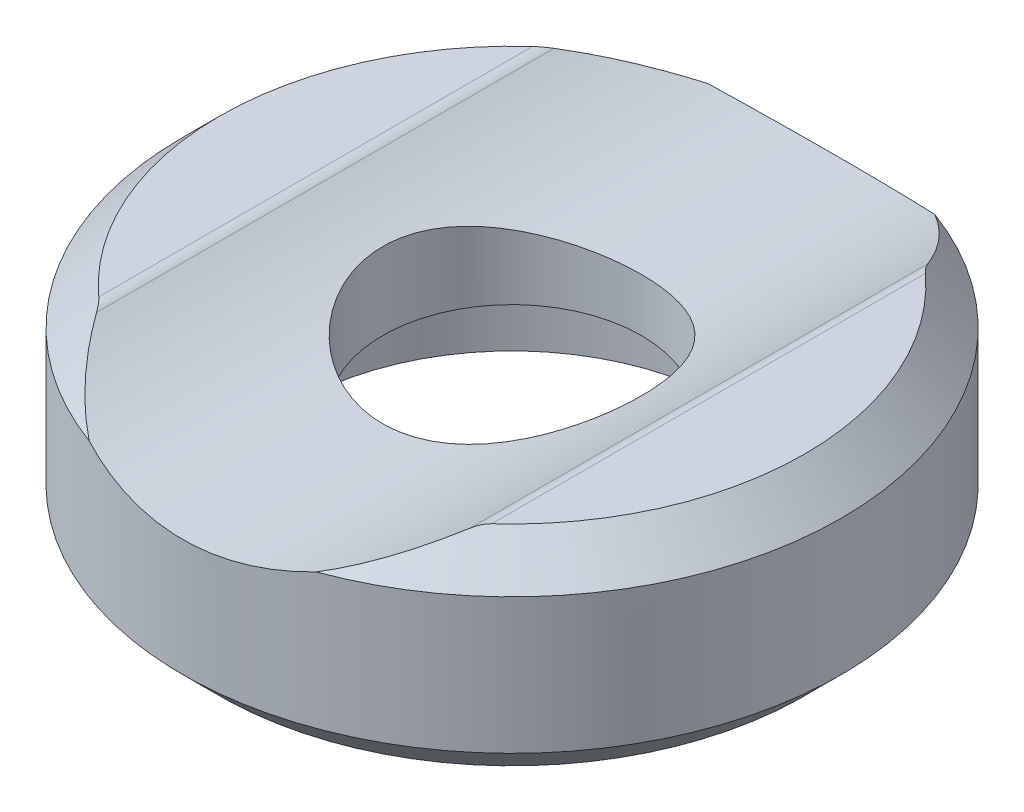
ISO-10303-21;
HEADER;
FILE_DESCRIPTION(('STEP AP214'),'2;1');
FILE_NAME('part.step','',(''),(''),'','','');
FILE_SCHEMA(('AUTOMOTIVE_DESIGN { 1 0 10303 214 1 1 1 1 }'));
ENDSEC;
DATA;
#1=APPLICATION_CONTEXT('core data for automotive mechanical design processes');
#2=APPLICATION_PROTOCOL_DEFINITION('international standard','automotive_design',2000,#1);
#3=PRODUCT_CONTEXT('',#1,'mechanical');
#4=PRODUCT('Part','Part','',(#3));
#5=PRODUCT_RELATED_PRODUCT_CATEGORY('part','',(#4));
#6=PRODUCT_DEFINITION_FORMATION('','',#4);
#7=PRODUCT_DEFINITION_CONTEXT('part definition',#1,'design');
#8=PRODUCT_DEFINITION('design','',#6,#7);
#9=PRODUCT_DEFINITION_SHAPE('','',#8);
#10=(LENGTH_UNIT() NAMED_UNIT(*) SI_UNIT(.MILLI.,.METRE.));
#11=(NAMED_UNIT(*) PLANE_ANGLE_UNIT() SI_UNIT($,.RADIAN.));
#12=(NAMED_UNIT(*) SI_UNIT($,.STERADIAN.) SOLID_ANGLE_UNIT());
#13=UNCERTAINTY_MEASURE_WITH_UNIT(LENGTH_MEASURE(1.E-05),#10,'distance_accuracy_value','');
#14=(GEOMETRIC_REPRESENTATION_CONTEXT(3) GLOBAL_UNCERTAINTY_ASSIGNED_CONTEXT((#13)) GLOBAL_UNIT_ASSIGNED_CONTEXT((#10,
#11,#12)) REPRESENTATION_CONTEXT('',''));
#15=CARTESIAN_POINT('',(0.,0.,0.));
#16=DIRECTION('',(0.,0.,1.));
#17=DIRECTION('',(1.,0.,0.));
#18=AXIS2_PLACEMENT_3D('',#15,#16,#17);
#19=CARTESIAN_POINT('',(0.,0.,0.));
#20=DIRECTION('',(0.,-1.,0.));
#21=DIRECTION('',(0.,0.,-1.));
#22=AXIS2_PLACEMENT_3D('',#19,#20,#21);
#23=CYLINDRICAL_SURFACE('',#22,2.1);
#24=CARTESIAN_POINT('',(0.,1.64120486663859,0.));
#25=DIRECTION('',(0.,-1.,0.));
#26=DIRECTION('',(0.,0.,-1.));
#27=AXIS2_PLACEMENT_3D('',#24,#25,#26);
#28=CIRCLE('',#27,2.1);
#29=CARTESIAN_POINT('',(0.,1.64120486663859,-2.1));
#30=VERTEX_POINT('',#29);
#31=EDGE_CURVE('E85',#30,#30,#28,.T.);
#32=ORIENTED_EDGE('',*,*,#31,.T.);
#33=EDGE_LOOP('',(#32));
#34=FACE_BOUND('',#33,.T.);
#35=CARTESIAN_POINT('',(0.,2.5,-2.1));
#36=CARTESIAN_POINT('',(-0.113834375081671,2.50000489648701,-2.09999346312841));
#37=CARTESIAN_POINT('',(-0.227778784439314,2.50338724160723,-2.09070011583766));
#38=CARTESIAN_POINT('',(-0.452399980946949,2.51657143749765,-2.05385739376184));
#39=CARTESIAN_POINT('',(-0.563071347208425,2.52638337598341,-2.02627933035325));
#40=CARTESIAN_POINT('',(-0.777689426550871,2.55136160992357,-1.9539669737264));
#41=CARTESIAN_POINT('',(-0.881652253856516,2.56651446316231,-1.90927572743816));
#42=CARTESIAN_POINT('',(-1.08056265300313,2.60065068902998,-1.80417450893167));
#43=CARTESIAN_POINT('',(-1.17551089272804,2.61963377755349,-1.74376570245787));
#44=CARTESIAN_POINT('',(-1.35755210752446,2.66031307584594,-1.60639969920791));
#45=CARTESIAN_POINT('',(-1.44423631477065,2.68208262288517,-1.52892262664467));
#46=CARTESIAN_POINT('',(-1.60370788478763,2.72550762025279,-1.36072028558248));
#47=CARTESIAN_POINT('',(-1.67649072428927,2.74716303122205,-1.26999072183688));
#48=CARTESIAN_POINT('',(-1.8085904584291,2.7887411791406,-1.07398564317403));
#49=CARTESIAN_POINT('',(-1.86734722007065,2.80857680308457,-0.968312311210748));
#50=CARTESIAN_POINT('',(-1.96607492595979,2.84314138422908,-0.747751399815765));
#51=CARTESIAN_POINT('',(-2.00605284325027,2.85787223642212,-0.632867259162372));
#52=CARTESIAN_POINT('',(-2.06450573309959,2.87978208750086,-0.401818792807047));
#53=CARTESIAN_POINT('',(-2.0837538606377,2.88723158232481,-0.285876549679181));
#54=CARTESIAN_POINT('',(-2.10261843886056,2.89452979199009,-0.0521870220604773));
#55=CARTESIAN_POINT('',(-2.10224231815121,2.89438138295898,0.0655595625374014));
#56=CARTESIAN_POINT('',(-2.08246322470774,2.88673504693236,0.292602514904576));
#57=CARTESIAN_POINT('',(-2.06411143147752,2.87964316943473,0.402006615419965));
#58=CARTESIAN_POINT('',(-2.01063216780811,2.8595804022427,0.616062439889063));
#59=CARTESIAN_POINT('',(-1.97550227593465,2.84660866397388,0.72071347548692));
#60=CARTESIAN_POINT('',(-1.88885121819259,2.81598888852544,0.924514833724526));
#61=CARTESIAN_POINT('',(-1.83704482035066,2.79826044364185,1.02353127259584));
#62=CARTESIAN_POINT('',(-1.71871230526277,2.76015492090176,1.21177435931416));
#63=CARTESIAN_POINT('',(-1.65218206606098,2.73977710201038,1.30099825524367));
#64=CARTESIAN_POINT('',(-1.50141514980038,2.69712093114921,1.4729649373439));
#65=CARTESIAN_POINT('',(-1.4163348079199,2.67480318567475,1.55495992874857));
#66=CARTESIAN_POINT('',(-1.23333530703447,2.63186921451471,1.70375888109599));
#67=CARTESIAN_POINT('',(-1.13541036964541,2.61125376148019,1.77055596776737));
#68=CARTESIAN_POINT('',(-0.927669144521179,2.57368141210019,1.88781878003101));
#69=CARTESIAN_POINT('',(-0.817703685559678,2.55678065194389,1.93803901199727));
#70=CARTESIAN_POINT('',(-0.590234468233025,2.52897988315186,2.01894346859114));
#71=CARTESIAN_POINT('',(-0.472746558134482,2.51806769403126,2.04966736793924));
#72=CARTESIAN_POINT('',(-0.295116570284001,2.50721584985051,2.08000446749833));
#73=CARTESIAN_POINT('',(-0.236386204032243,2.5045187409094,2.08749239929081));
#74=CARTESIAN_POINT('',(-0.118447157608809,2.50090954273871,2.0974918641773));
#75=CARTESIAN_POINT('',(-0.0592384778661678,2.4999974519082,2.10000340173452));
#76=CARTESIAN_POINT('',(0.113834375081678,2.50000489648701,2.09999346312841));
#77=CARTESIAN_POINT('',(0.227778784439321,2.50338724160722,2.09070011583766));
#78=CARTESIAN_POINT('',(0.452399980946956,2.51657143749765,2.05385739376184));
#79=CARTESIAN_POINT('',(0.563071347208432,2.52638337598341,2.02627933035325));
#80=CARTESIAN_POINT('',(0.777689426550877,2.55136160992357,1.95396697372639));
#81=CARTESIAN_POINT('',(0.881652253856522,2.56651446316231,1.90927572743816));
#82=CARTESIAN_POINT('',(1.08056265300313,2.60065068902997,1.80417450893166));
#83=CARTESIAN_POINT('',(1.17551089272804,2.61963377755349,1.74376570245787));
#84=CARTESIAN_POINT('',(1.35755210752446,2.66031307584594,1.60639969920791));
#85=CARTESIAN_POINT('',(1.44423631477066,2.68208262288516,1.52892262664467));
#86=CARTESIAN_POINT('',(1.60370788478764,2.72550762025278,1.36072028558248));
#87=CARTESIAN_POINT('',(1.67649072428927,2.74716303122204,1.26999072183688));
#88=CARTESIAN_POINT('',(1.8085904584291,2.7887411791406,1.07398564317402));
#89=CARTESIAN_POINT('',(1.86734722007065,2.80857680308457,0.968312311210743));
#90=CARTESIAN_POINT('',(1.96607492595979,2.84314138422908,0.747751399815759));
#91=CARTESIAN_POINT('',(2.00605284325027,2.85787223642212,0.632867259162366));
#92=CARTESIAN_POINT('',(2.06450573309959,2.87978208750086,0.401818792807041));
#93=CARTESIAN_POINT('',(2.0837538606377,2.88723158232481,0.285876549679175));
#94=CARTESIAN_POINT('',(2.10261843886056,2.89452979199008,0.0521870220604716));
#95=CARTESIAN_POINT('',(2.10224231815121,2.89438138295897,-0.0655595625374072));
#96=CARTESIAN_POINT('',(2.08246322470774,2.88673504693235,-0.292602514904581));
#97=CARTESIAN_POINT('',(2.06411143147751,2.87964316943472,-0.40200661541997));
#98=CARTESIAN_POINT('',(2.01063216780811,2.85958040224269,-0.616062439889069));
#99=CARTESIAN_POINT('',(1.97550227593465,2.84660866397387,-0.720713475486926));
#100=CARTESIAN_POINT('',(1.88885121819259,2.81598888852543,-0.924514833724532));
#101=CARTESIAN_POINT('',(1.83704482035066,2.79826044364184,-1.02353127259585));
#102=CARTESIAN_POINT('',(1.71871230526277,2.76015492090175,-1.21177435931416));
#103=CARTESIAN_POINT('',(1.65218206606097,2.73977710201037,-1.30099825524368));
#104=CARTESIAN_POINT('',(1.50141514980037,2.6971209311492,-1.4729649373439));
#105=CARTESIAN_POINT('',(1.4163348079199,2.67480318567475,-1.55495992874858));
#106=CARTESIAN_POINT('',(1.23333530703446,2.6318692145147,-1.703758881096));
#107=CARTESIAN_POINT('',(1.1354103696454,2.61125376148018,-1.77055596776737));
#108=CARTESIAN_POINT('',(0.927669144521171,2.57368141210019,-1.88781878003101));
#109=CARTESIAN_POINT('',(0.81770368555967,2.55678065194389,-1.93803901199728));
#110=CARTESIAN_POINT('',(0.590234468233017,2.52897988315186,-2.01894346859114));
#111=CARTESIAN_POINT('',(0.472746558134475,2.51806769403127,-2.04966736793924));
#112=CARTESIAN_POINT('',(0.295116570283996,2.50721584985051,-2.08000446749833));
#113=CARTESIAN_POINT('',(0.236386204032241,2.5045187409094,-2.08749239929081));
#114=CARTESIAN_POINT('',(0.118447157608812,2.50090954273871,-2.0974918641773));
#115=CARTESIAN_POINT('',(0.0592384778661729,2.4999974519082,-2.10000340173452));
#116=CARTESIAN_POINT('',(0.,2.5,-2.1));
#117=B_SPLINE_CURVE_WITH_KNOTS('',3,(#35,#36,#37,#38,#39,#40,#41,#42,#43,#44,#45,#46,#47,#48,
#49,#50,#51,#52,#53,#54,#55,#56,#57,#58,#59,#60,#61,#62,#63,#64,#65,#66,#67,#68,#69,#70,#71,#72,
#73,#74,#75,#76,#77,#78,#79,#80,#81,#82,#83,#84,#85,#86,#87,#88,#89,#90,#91,#92,#93,#94,#95,#96,
#97,#98,#99,#100,#101,#102,#103,#104,#105,#106,#107,#108,#109,#110,#111,#112,#113,#114,#115,
#116),.UNSPECIFIED.,.T.,.F.,(4,2,2,2,2,2,2,2,2,2,2,2,2,2,2,2,2,2,2,2,2,2,2,2,2,2,2,2,2,2,2,2,2,
2,2,2,2,2,2,2,4),(0.,0.341273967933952,0.683084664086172,1.02404114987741,1.36497235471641,
1.71824488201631,2.07163216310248,2.43738163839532,2.80299519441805,3.15444231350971,
3.50575639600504,3.83768252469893,4.16965657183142,4.50764064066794,4.84571944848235,
5.20481669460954,5.56407604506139,5.92843923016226,6.29205854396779,6.46965488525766,
6.64725106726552,6.98852503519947,7.33033573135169,7.67129221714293,8.01222342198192,
8.36549594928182,8.71888323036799,9.08463270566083,9.45024626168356,9.80169338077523,
10.1530074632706,10.4849335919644,10.8169076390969,11.1548917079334,11.4929705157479,
11.8520677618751,12.2113271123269,12.5756902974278,12.9393096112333,13.1169059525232,
13.294502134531),.UNSPECIFIED.);
#118=CARTESIAN_POINT('',(0.,2.5,-2.1));
#119=VERTEX_POINT('',#118);
#120=EDGE_CURVE('E158',#119,#119,#117,.T.);
#121=ORIENTED_EDGE('',*,*,#120,.T.);
#122=EDGE_LOOP('',(#121));
#123=FACE_BOUND('',#122,.T.);
#124=ADVANCED_FACE('F14',(#34,#123),#23,.F.);
#125=CARTESIAN_POINT('',(0.,0.,0.));
#126=DIRECTION('',(0.,-1.,0.));
#127=DIRECTION('',(0.,0.,-1.));
#128=AXIS2_PLACEMENT_3D('',#125,#126,#127);
#129=CYLINDRICAL_SURFACE('',#128,5.35);
#130=CARTESIAN_POINT('',(-1.84119526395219,2.8,-5.02319619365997));
#131=CARTESIAN_POINT('',(-1.73657275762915,2.76495994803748,-5.06156008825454));
#132=CARTESIAN_POINT('',(-1.62991848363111,2.73259209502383,-5.09692951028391));
#133=CARTESIAN_POINT('',(-1.41300381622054,2.67363178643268,-5.16126837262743));
#134=CARTESIAN_POINT('',(-1.30273945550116,2.64704594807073,-5.19023048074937));
#135=CARTESIAN_POINT('',(-1.0799133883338,2.60029067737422,-5.24111486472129));
#136=CARTESIAN_POINT('',(-0.967367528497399,2.5800869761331,-5.26307474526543));
#137=CARTESIAN_POINT('',(-0.740207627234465,2.54628294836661,-5.29979357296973));
#138=CARTESIAN_POINT('',(-0.625595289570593,2.53267741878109,-5.31455819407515));
#139=CARTESIAN_POINT('',(-0.425779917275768,2.51502604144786,-5.33370725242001));
#140=CARTESIAN_POINT('',(-0.340874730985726,2.50939916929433,-5.33980902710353));
#141=CARTESIAN_POINT('',(-0.170649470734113,2.50188463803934,-5.34795701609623));
#142=CARTESIAN_POINT('',(-0.085329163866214,2.49999940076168,-5.35000060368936));
#143=CARTESIAN_POINT('',(0.116454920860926,2.50000081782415,-5.3499991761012));
#144=CARTESIAN_POINT('',(0.232926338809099,2.50351420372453,-5.34619083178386));
#145=CARTESIAN_POINT('',(0.465012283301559,2.51750131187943,-5.33102236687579));
#146=CARTESIAN_POINT('',(0.580626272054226,2.52797908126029,-5.3196578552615));
#147=CARTESIAN_POINT('',(0.810197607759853,2.55570167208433,-5.28956497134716));
#148=CARTESIAN_POINT('',(0.924152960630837,2.57295403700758,-5.27082839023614));
#149=CARTESIAN_POINT('',(1.14950261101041,2.61389773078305,-5.22631181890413));
#150=CARTESIAN_POINT('',(1.26089685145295,2.63758920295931,-5.20053167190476));
#151=CARTESIAN_POINT('',(1.45109980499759,2.68384781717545,-5.15012011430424));
#152=CARTESIAN_POINT('',(1.53066265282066,2.70502406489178,-5.12702218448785));
#153=CARTESIAN_POINT('',(1.68756388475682,2.75033516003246,-5.07753650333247));
#154=CARTESIAN_POINT('',(1.76490923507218,2.77445910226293,-5.0511608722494));
#155=CARTESIAN_POINT('',(1.8411952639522,2.8,-5.02319619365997));
#156=B_SPLINE_CURVE_WITH_KNOTS('',3,(#130,#131,#132,#133,#134,#135,#136,#137,#138,#139,#140,
#141,#142,#143,#144,#145,#146,#147,#148,#149,#150,#151,#152,#153,#154,#155),.UNSPECIFIED.,.F.,
.F.,(4,2,2,2,2,2,2,2,2,2,2,2,4),(0.,0.350408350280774,0.701215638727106,1.0501059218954,
1.3987206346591,1.6544801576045,1.91040517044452,2.2596846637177,2.60916730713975,
2.95904020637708,3.30892089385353,3.56531823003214,3.82079420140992),.UNSPECIFIED.);
#157=CARTESIAN_POINT('',(-1.84119526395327,2.80000000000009,-5.02319619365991));
#158=VERTEX_POINT('',#157);
#159=CARTESIAN_POINT('',(1.84119526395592,2.80000000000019,-5.02319619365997));
#160=VERTEX_POINT('',#159);
#161=EDGE_CURVE('E43',#158,#160,#156,.T.);
#162=ORIENTED_EDGE('',*,*,#161,.T.);
#163=CARTESIAN_POINT('',(0.,2.8,0.));
#164=DIRECTION('',(0.,-1.,0.));
#165=DIRECTION('',(0.,0.,-1.));
#166=AXIS2_PLACEMENT_3D('',#163,#164,#165);
#167=CIRCLE('',#166,5.35);
#168=CARTESIAN_POINT('',(1.84119526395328,2.80000000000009,5.0231961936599));
#169=VERTEX_POINT('',#168);
#170=EDGE_CURVE('E155',#160,#169,#167,.T.);
#171=ORIENTED_EDGE('',*,*,#170,.T.);
#172=CARTESIAN_POINT('',(1.8411952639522,2.8,5.02319619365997));
#173=CARTESIAN_POINT('',(1.73657275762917,2.76495994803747,5.06156008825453));
#174=CARTESIAN_POINT('',(1.62991848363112,2.73259209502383,5.09692951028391));
#175=CARTESIAN_POINT('',(1.41300381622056,2.67363178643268,5.16126837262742));
#176=CARTESIAN_POINT('',(1.30273945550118,2.64704594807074,5.19023048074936));
#177=CARTESIAN_POINT('',(1.07991338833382,2.60029067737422,5.24111486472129));
#178=CARTESIAN_POINT('',(0.967367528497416,2.5800869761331,5.26307474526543));
#179=CARTESIAN_POINT('',(0.74020762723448,2.54628294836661,5.29979357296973));
#180=CARTESIAN_POINT('',(0.625595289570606,2.53267741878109,5.31455819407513));
#181=CARTESIAN_POINT('',(0.425779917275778,2.51502604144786,5.33370725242));
#182=CARTESIAN_POINT('',(0.340874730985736,2.50939916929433,5.33980902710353));
#183=CARTESIAN_POINT('',(0.170649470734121,2.50188463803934,5.34795701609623));
#184=CARTESIAN_POINT('',(0.0853291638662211,2.49999940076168,5.35000060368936));
#185=CARTESIAN_POINT('',(-0.11645492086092,2.50000081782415,5.34999917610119));
#186=CARTESIAN_POINT('',(-0.232926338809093,2.50351420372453,5.34619083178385));
#187=CARTESIAN_POINT('',(-0.465012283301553,2.51750131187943,5.33102236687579));
#188=CARTESIAN_POINT('',(-0.58062627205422,2.52797908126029,5.3196578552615));
#189=CARTESIAN_POINT('',(-0.810197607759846,2.55570167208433,5.28956497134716));
#190=CARTESIAN_POINT('',(-0.924152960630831,2.57295403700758,5.27082839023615));
#191=CARTESIAN_POINT('',(-1.14950261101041,2.61389773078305,5.22631181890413));
#192=CARTESIAN_POINT('',(-1.26089685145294,2.63758920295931,5.20053167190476));
#193=CARTESIAN_POINT('',(-1.45109980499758,2.68384781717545,5.15012011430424));
#194=CARTESIAN_POINT('',(-1.53066265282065,2.70502406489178,5.12702218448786));
#195=CARTESIAN_POINT('',(-1.6875638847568,2.75033516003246,5.07753650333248));
#196=CARTESIAN_POINT('',(-1.76490923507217,2.77445910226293,5.0511608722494));
#197=CARTESIAN_POINT('',(-1.84119526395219,2.8,5.02319619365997));
#198=B_SPLINE_CURVE_WITH_KNOTS('',3,(#172,#173,#174,#175,#176,#177,#178,#179,#180,#181,#182,
#183,#184,#185,#186,#187,#188,#189,#190,#191,#192,#193,#194,#195,#196,#197),.UNSPECIFIED.,.F.,
.F.,(4,2,2,2,2,2,2,2,2,2,2,2,4),(0.,0.350408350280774,0.701215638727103,1.0501059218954,
1.3987206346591,1.6544801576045,1.91040517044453,2.2596846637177,2.60916730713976,
2.95904020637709,3.30892089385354,3.56531823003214,3.82079420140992),.UNSPECIFIED.);
#199=CARTESIAN_POINT('',(-1.84119526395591,2.80000000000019,5.02319619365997));
#200=VERTEX_POINT('',#199);
#201=EDGE_CURVE('E150',#169,#200,#198,.T.);
#202=ORIENTED_EDGE('',*,*,#201,.T.);
#203=EDGE_CURVE('E78',#200,#158,#167,.T.);
#204=ORIENTED_EDGE('',*,*,#203,.T.);
#205=EDGE_LOOP('',(#162,#171,#202,#204));
#206=FACE_BOUND('',#205,.T.);
#207=CARTESIAN_POINT('',(0.,0.6,0.));
#208=DIRECTION('',(0.,-1.,0.));
#209=DIRECTION('',(0.,0.,-1.));
#210=AXIS2_PLACEMENT_3D('',#207,#208,#209);
#211=CIRCLE('',#210,5.35);
#212=CARTESIAN_POINT('',(0.,0.6,-5.35));
#213=VERTEX_POINT('',#212);
#214=EDGE_CURVE('E215',#213,#213,#211,.T.);
#215=ORIENTED_EDGE('',*,*,#214,.F.);
#216=EDGE_LOOP('',(#215));
#217=FACE_BOUND('',#216,.T.);
#218=ADVANCED_FACE('F153',(#206,#217),#129,.T.);
#219=CARTESIAN_POINT('',(0.,2.8,0.));
#220=DIRECTION('',(0.,-1.,0.));
#221=DIRECTION('',(0.,0.,-1.));
#222=AXIS2_PLACEMENT_3D('',#219,#220,#221);
#223=CONICAL_SURFACE('',#222,5.35,0.785398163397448);
#224=ORIENTED_EDGE('',*,*,#170,.F.);
#225=CARTESIAN_POINT('',(1.66534615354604,2.74422622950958,-5.142860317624));
#226=CARTESIAN_POINT('',(1.77685973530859,2.77766710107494,-5.07158142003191));
#227=CARTESIAN_POINT('',(1.88384919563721,2.81338115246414,-4.99463492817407));
#228=CARTESIAN_POINT('',(2.08875634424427,2.88806825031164,-4.83123296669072));
#229=CARTESIAN_POINT('',(2.18669047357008,2.92703513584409,-4.74479537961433));
#230=CARTESIAN_POINT('',(2.37231759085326,3.00640738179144,-4.56546583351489));
#231=CARTESIAN_POINT('',(2.46015390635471,3.0467780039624,-4.47270525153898));
#232=CARTESIAN_POINT('',(2.62779720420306,3.12859953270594,-4.28062174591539));
#233=CARTESIAN_POINT('',(2.70760265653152,3.17005064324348,-4.1812975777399));
#234=CARTESIAN_POINT('',(2.84452268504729,3.24495083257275,-3.9971901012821));
#235=CARTESIAN_POINT('',(2.9030079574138,3.27836550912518,-3.91340319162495));
#236=CARTESIAN_POINT('',(3.0155728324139,3.34514204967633,-3.74198102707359));
#237=CARTESIAN_POINT('',(3.06961933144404,3.37850196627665,-3.65432324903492));
#238=CARTESIAN_POINT('',(3.12132663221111,3.41151147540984,-3.56519193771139));
#239=B_SPLINE_CURVE_WITH_KNOTS('',3,(#225,#226,#227,#228,#229,#230,#231,#232,#233,#234,#235,
#236,#237,#238),.UNSPECIFIED.,.F.,.F.,(4,2,2,2,2,2,4),(0.,0.409053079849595,0.81734825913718,
1.2188475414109,1.62042317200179,1.94278602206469,2.26736822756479),.UNSPECIFIED.);
#240=CARTESIAN_POINT('',(3.0322055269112,3.35573770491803,-3.713580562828));
#241=VERTEX_POINT('',#240);
#242=EDGE_CURVE('E90',#160,#241,#239,.T.);
#243=ORIENTED_EDGE('',*,*,#242,.T.);
#244=CARTESIAN_POINT('',(3.20492756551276,3.39957921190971,-3.50641368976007));
#245=CARTESIAN_POINT('',(3.19511545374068,3.40009307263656,-3.51468653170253));
#246=CARTESIAN_POINT('',(3.18558303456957,3.4001220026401,-3.52328921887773));
#247=CARTESIAN_POINT('',(3.16706413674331,3.39933841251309,-3.54099604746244));
#248=CARTESIAN_POINT('',(3.15807663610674,3.39852752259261,-3.55009918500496));
#249=CARTESIAN_POINT('',(3.13210470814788,3.39505997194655,-3.57770898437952));
#250=CARTESIAN_POINT('',(3.11583442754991,3.39137545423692,-3.59675895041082));
#251=CARTESIAN_POINT('',(3.08655030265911,3.38232390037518,-3.63378964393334));
#252=CARTESIAN_POINT('',(3.07337367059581,3.3771547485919,-3.65169483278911));
#253=CARTESIAN_POINT('',(3.04820533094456,3.36525040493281,-3.68818867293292));
#254=CARTESIAN_POINT('',(3.03623116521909,3.35849581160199,-3.70678317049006));
#255=CARTESIAN_POINT('',(3.02490043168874,3.35111147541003,-3.72549438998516));
#256=B_SPLINE_CURVE_WITH_KNOTS('',3,(#244,#245,#246,#247,#248,#249,#250,#251,#252,#253,#254,
#255),.UNSPECIFIED.,.F.,.F.,(4,2,2,2,2,4),(0.,0.0384856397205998,0.0768967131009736,
0.152626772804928,0.221010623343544,0.290279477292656),.UNSPECIFIED.);
#257=CARTESIAN_POINT('',(3.18904374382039,3.4,-3.52029828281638));
#258=VERTEX_POINT('',#257);
#259=EDGE_CURVE('E82',#258,#241,#256,.T.);
#260=ORIENTED_EDGE('',*,*,#259,.F.);
#261=CARTESIAN_POINT('',(0.,3.4,0.));
#262=DIRECTION('',(0.,-1.,0.));
#263=DIRECTION('',(0.,0.,-1.));
#264=AXIS2_PLACEMENT_3D('',#261,#262,#263);
#265=CIRCLE('',#264,4.75);
#266=CARTESIAN_POINT('',(3.18904374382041,3.4,3.52029828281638));
#267=VERTEX_POINT('',#266);
#268=EDGE_CURVE('E73',#258,#267,#265,.T.);
#269=ORIENTED_EDGE('',*,*,#268,.T.);
#270=CARTESIAN_POINT('',(3.02490043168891,3.35111147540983,3.72549438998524));
#271=CARTESIAN_POINT('',(3.03528530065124,3.35788476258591,3.70833841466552));
#272=CARTESIAN_POINT('',(3.04621812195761,3.36412618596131,3.69127766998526));
#273=CARTESIAN_POINT('',(3.0693193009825,3.375380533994,3.65741158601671));
#274=CARTESIAN_POINT('',(3.08149564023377,3.3803847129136,3.64060881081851));
#275=CARTESIAN_POINT('',(3.1066911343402,3.38877072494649,3.60806988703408));
#276=CARTESIAN_POINT('',(3.119673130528,3.39219748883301,3.59231683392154));
#277=CARTESIAN_POINT('',(3.14686265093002,3.39734149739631,3.56166094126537));
#278=CARTESIAN_POINT('',(3.16106608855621,3.39906421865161,3.54675552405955));
#279=CARTESIAN_POINT('',(3.18062296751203,3.39991816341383,3.52802456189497));
#280=CARTESIAN_POINT('',(3.18537318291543,3.40001623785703,3.52360406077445));
#281=CARTESIAN_POINT('',(3.19503374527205,3.39997927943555,3.51489667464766));
#282=CARTESIAN_POINT('',(3.19994473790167,3.39984315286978,3.51061051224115));
#283=CARTESIAN_POINT('',(3.20492756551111,3.39957921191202,3.50641368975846));
#284=B_SPLINE_CURVE_WITH_KNOTS('',3,(#270,#271,#272,#273,#274,#275,#276,#277,#278,#279,#280,
#281,#282,#283),.UNSPECIFIED.,.F.,.F.,(4,2,2,2,2,2,4),(0.,0.0635207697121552,0.127478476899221,
0.189480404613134,0.25128241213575,0.270745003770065,0.290298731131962),.UNSPECIFIED.);
#285=CARTESIAN_POINT('',(3.0322055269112,3.35573770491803,3.713580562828));
#286=VERTEX_POINT('',#285);
#287=EDGE_CURVE('E35',#286,#267,#284,.T.);
#288=ORIENTED_EDGE('',*,*,#287,.F.);
#289=CARTESIAN_POINT('',(3.12132663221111,3.41151147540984,3.56519193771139));
#290=CARTESIAN_POINT('',(3.04649551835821,3.36375814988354,3.69413057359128));
#291=CARTESIAN_POINT('',(2.96676223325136,3.31524099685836,3.82006864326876));
#292=CARTESIAN_POINT('',(2.79664010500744,3.21782331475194,4.0651217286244));
#293=CARTESIAN_POINT('',(2.70621272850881,3.16892203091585,4.18420962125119));
#294=CARTESIAN_POINT('',(2.51673118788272,3.07343034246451,4.41097191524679));
#295=CARTESIAN_POINT('',(2.41794017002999,3.0268126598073,4.51885339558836));
#296=CARTESIAN_POINT('',(2.20956112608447,2.93616558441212,4.72453616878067));
#297=CARTESIAN_POINT('',(2.09999407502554,2.89213141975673,4.822356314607));
#298=CARTESIAN_POINT('',(1.93394201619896,2.83165443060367,4.95465047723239));
#299=CARTESIAN_POINT('',(1.88193459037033,2.81352072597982,4.99402579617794));
#300=CARTESIAN_POINT('',(1.77544601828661,2.77813847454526,5.07037333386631));
#301=CARTESIAN_POINT('',(1.72095318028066,2.76089515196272,5.1073316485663));
#302=CARTESIAN_POINT('',(1.66534615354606,2.74422622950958,5.14286031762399));
#303=B_SPLINE_CURVE_WITH_KNOTS('',3,(#289,#290,#291,#292,#293,#294,#295,#296,#297,#298,#299,
#300,#301,#302),.UNSPECIFIED.,.F.,.F.,(4,2,2,2,2,2,4),(0.,0.469679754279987,0.941106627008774,
1.40107352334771,1.86016219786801,2.06319802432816,2.26731437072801),.UNSPECIFIED.);
#304=EDGE_CURVE('E129',#286,#169,#303,.T.);
#305=ORIENTED_EDGE('',*,*,#304,.T.);
#306=EDGE_LOOP('',(#224,#243,#260,#269,#288,#305));
#307=FACE_BOUND('',#306,.T.);
#308=ADVANCED_FACE('F89',(#307),#223,.T.);
#309=CARTESIAN_POINT('',(4.75,3.4,0.));
#310=DIRECTION('',(0.,1.,0.));
#311=DIRECTION('',(0.,0.,1.));
#312=AXIS2_PLACEMENT_3D('',#309,#310,#311);
#313=PLANE('',#312);
#314=ORIENTED_EDGE('',*,*,#268,.F.);
#315=DIRECTION('',(0.,0.,-1.));
#316=VECTOR('',#315,1.);
#317=CARTESIAN_POINT('',(3.18904374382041,3.4,6.35));
#318=LINE('',#317,#316);
#319=EDGE_CURVE('E75',#258,#267,#318,.F.);
#320=ORIENTED_EDGE('',*,*,#319,.T.);
#321=EDGE_LOOP('',(#314,#320));
#322=FACE_BOUND('',#321,.T.);
#323=ADVANCED_FACE('F74',(#322),#313,.T.);
#324=CARTESIAN_POINT('',(0.,1.64120486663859,0.));
#325=DIRECTION('',(0.,-1.,0.));
#326=DIRECTION('',(0.,0.,-1.));
#327=AXIS2_PLACEMENT_3D('',#324,#325,#326);
#328=CONICAL_SURFACE('',#327,2.1,1.02974425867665);
#329=CARTESIAN_POINT('',(0.,0.8,0.));
#330=DIRECTION('',(0.,-1.,0.));
#331=DIRECTION('',(0.,0.,-1.));
#332=AXIS2_PLACEMENT_3D('',#329,#330,#331);
#333=CIRCLE('',#332,3.5);
#334=CARTESIAN_POINT('',(0.,0.8,-3.5));
#335=VERTEX_POINT('',#334);
#336=EDGE_CURVE('E224',#335,#335,#333,.T.);
#337=ORIENTED_EDGE('',*,*,#336,.T.);
#338=EDGE_LOOP('',(#337));
#339=FACE_BOUND('',#338,.T.);
#340=ORIENTED_EDGE('',*,*,#31,.F.);
#341=EDGE_LOOP('',(#340));
#342=FACE_BOUND('',#341,.T.);
#343=ADVANCED_FACE('F188',(#339,#342),#328,.F.);
#344=CARTESIAN_POINT('',(0.,0.,0.));
#345=DIRECTION('',(0.,-1.,0.));
#346=DIRECTION('',(0.,0.,-1.));
#347=AXIS2_PLACEMENT_3D('',#344,#345,#346);
#348=CYLINDRICAL_SURFACE('',#347,3.5);
#349=CARTESIAN_POINT('',(0.,0.,0.));
#350=DIRECTION('',(0.,-1.,0.));
#351=DIRECTION('',(0.,0.,-1.));
#352=AXIS2_PLACEMENT_3D('',#349,#350,#351);
#353=CIRCLE('',#352,3.5);
#354=CARTESIAN_POINT('',(0.,0.,-3.5));
#355=VERTEX_POINT('',#354);
#356=EDGE_CURVE('E221',#355,#355,#353,.T.);
#357=ORIENTED_EDGE('',*,*,#356,.T.);
#358=EDGE_LOOP('',(#357));
#359=FACE_BOUND('',#358,.T.);
#360=ORIENTED_EDGE('',*,*,#336,.F.);
#361=EDGE_LOOP('',(#360));
#362=FACE_BOUND('',#361,.T.);
#363=ADVANCED_FACE('F185',(#359,#362),#348,.F.);
#364=CARTESIAN_POINT('',(3.5,0.,0.));
#365=DIRECTION('',(0.,-1.,0.));
#366=DIRECTION('',(0.,0.,-1.));
#367=AXIS2_PLACEMENT_3D('',#364,#365,#366);
#368=PLANE('',#367);
#369=CARTESIAN_POINT('',(0.,0.,0.));
#370=DIRECTION('',(0.,-1.,0.));
#371=DIRECTION('',(0.,0.,-1.));
#372=AXIS2_PLACEMENT_3D('',#369,#370,#371);
#373=CIRCLE('',#372,4.75);
#374=CARTESIAN_POINT('',(0.,0.,-4.75));
#375=VERTEX_POINT('',#374);
#376=EDGE_CURVE('E218',#375,#375,#373,.T.);
#377=ORIENTED_EDGE('',*,*,#376,.T.);
#378=EDGE_LOOP('',(#377));
#379=FACE_BOUND('',#378,.T.);
#380=ORIENTED_EDGE('',*,*,#356,.F.);
#381=EDGE_LOOP('',(#380));
#382=FACE_BOUND('',#381,.T.);
#383=ADVANCED_FACE('F181',(#379,#382),#368,.T.);
#384=CARTESIAN_POINT('',(0.,0.,0.));
#385=DIRECTION('',(0.,1.,0.));
#386=DIRECTION('',(0.,0.,1.));
#387=AXIS2_PLACEMENT_3D('',#384,#385,#386);
#388=CONICAL_SURFACE('',#387,4.75,0.785398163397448);
#389=ORIENTED_EDGE('',*,*,#214,.T.);
#390=EDGE_LOOP('',(#389));
#391=FACE_BOUND('',#390,.T.);
#392=ORIENTED_EDGE('',*,*,#376,.F.);
#393=EDGE_LOOP('',(#392));
#394=FACE_BOUND('',#393,.T.);
#395=ADVANCED_FACE('F177',(#391,#394),#388,.T.);
#396=CARTESIAN_POINT('',(-3.02490042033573,3.35111146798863,-3.72549440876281));
#397=CARTESIAN_POINT('',(-3.03528528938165,3.35788475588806,-3.70833843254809));
#398=CARTESIAN_POINT('',(-3.04621811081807,3.36412617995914,-3.69127768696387));
#399=CARTESIAN_POINT('',(-3.06931929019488,3.37538052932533,-3.65741160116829));
#400=CARTESIAN_POINT('',(-3.08149562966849,3.38038470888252,-3.64060882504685));
#401=CARTESIAN_POINT('',(-3.1066911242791,3.3887707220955,-3.60806989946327));
#402=CARTESIAN_POINT('',(-3.11967312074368,3.39219748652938,-3.59231684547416));
#403=CARTESIAN_POINT('',(-3.14686264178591,3.39734149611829,-3.56166095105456));
#404=CARTESIAN_POINT('',(-3.16106607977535,3.39906421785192,-3.54675553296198));
#405=CARTESIAN_POINT('',(-3.18062296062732,3.39991816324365,-3.52802456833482));
#406=CARTESIAN_POINT('',(-3.18537317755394,3.40001623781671,-3.52360406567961));
#407=CARTESIAN_POINT('',(-3.19503374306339,3.39997927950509,-3.51489667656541));
#408=CARTESIAN_POINT('',(-3.19994473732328,3.39984315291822,-3.5106105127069));
#409=CARTESIAN_POINT('',(-3.20492756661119,3.3995792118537,-3.50641368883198));
#410=B_SPLINE_CURVE_WITH_KNOTS('',3,(#396,#397,#398,#399,#400,#401,#402,#403,#404,#405,#406,
#407,#408,#409),.UNSPECIFIED.,.F.,.F.,(4,2,2,2,2,2,4),(0.,0.0635207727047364,0.127478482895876,
0.189480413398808,0.25128242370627,0.270745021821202,0.290298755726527),.UNSPECIFIED.);
#411=CARTESIAN_POINT('',(-3.0322055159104,3.35573769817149,-3.71358058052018));
#412=VERTEX_POINT('',#411);
#413=CARTESIAN_POINT('',(-3.18904374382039,3.4,-3.52029828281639));
#414=VERTEX_POINT('',#413);
#415=EDGE_CURVE('E156',#412,#414,#410,.T.);
#416=ORIENTED_EDGE('',*,*,#415,.F.);
#417=CARTESIAN_POINT('',(-3.12132662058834,3.41151146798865,-3.56519195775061));
#418=CARTESIAN_POINT('',(-3.04649550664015,3.36375814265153,-3.69413059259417));
#419=CARTESIAN_POINT('',(-2.96676222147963,3.3152409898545,-3.82006866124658));
#420=CARTESIAN_POINT('',(-2.79664009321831,3.21782330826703,-4.06512174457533));
#421=CARTESIAN_POINT('',(-2.70621271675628,3.16892202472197,-4.18420963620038));
#422=CARTESIAN_POINT('',(-2.51673117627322,3.07343033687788,-4.41097192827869));
#423=CARTESIAN_POINT('',(-2.41794015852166,3.02681265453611,-4.51885340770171));
#424=CARTESIAN_POINT('',(-2.20956111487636,2.93616557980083,-4.72453617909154));
#425=CARTESIAN_POINT('',(-2.09999406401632,2.89213141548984,-4.82235632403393));
#426=CARTESIAN_POINT('',(-1.93394200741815,2.8316544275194,-4.9546504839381));
#427=CARTESIAN_POINT('',(-1.88193458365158,2.81352072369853,-4.99402580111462));
#428=CARTESIAN_POINT('',(-1.77544601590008,2.77813847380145,-5.07037333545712));
#429=CARTESIAN_POINT('',(-1.72095318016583,2.76089515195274,-5.10733164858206));
#430=CARTESIAN_POINT('',(-1.66534615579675,2.74422623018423,-5.14286031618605));
#431=B_SPLINE_CURVE_WITH_KNOTS('',3,(#417,#418,#419,#420,#421,#422,#423,#424,#425,#426,#427,
#428,#429,#430),.UNSPECIFIED.,.F.,.F.,(4,2,2,2,2,2,4),(0.,0.469679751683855,0.941106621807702,
1.40107351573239,1.86016218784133,2.06319800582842,2.26731434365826),.UNSPECIFIED.);
#432=EDGE_CURVE('E9',#412,#158,#431,.T.);
#433=ORIENTED_EDGE('',*,*,#432,.T.);
#434=ORIENTED_EDGE('',*,*,#203,.F.);
#435=CARTESIAN_POINT('',(-1.66534615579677,2.74422623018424,5.14286031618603));
#436=CARTESIAN_POINT('',(-1.77685973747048,2.77766710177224,5.07158141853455));
#437=CARTESIAN_POINT('',(-1.88384919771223,2.81338115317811,4.99463492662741));
#438=CARTESIAN_POINT('',(-2.08875634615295,2.88806825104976,4.83123296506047));
#439=CARTESIAN_POINT('',(-2.18669047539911,2.92703513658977,4.74479537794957));
#440=CARTESIAN_POINT('',(-2.37231759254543,3.00640738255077,4.56546583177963));
#441=CARTESIAN_POINT('',(-2.46015390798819,3.04677800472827,4.47270524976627));
#442=CARTESIAN_POINT('',(-2.62779720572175,3.12859953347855,4.28062174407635));
#443=CARTESIAN_POINT('',(-2.70760265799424,3.17005064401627,4.1812975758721));
#444=CARTESIAN_POINT('',(-2.84452268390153,3.24495083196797,3.99719010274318));
#445=CARTESIAN_POINT('',(-2.90300795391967,3.27836550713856,3.91340319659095));
#446=CARTESIAN_POINT('',(-3.01557282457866,3.34514204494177,3.74198103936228));
#447=CARTESIAN_POINT('',(-3.06961932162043,3.37850196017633,3.65432326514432));
#448=CARTESIAN_POINT('',(-3.12132662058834,3.41151146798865,3.56519195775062));
#449=B_SPLINE_CURVE_WITH_KNOTS('',3,(#435,#436,#437,#438,#439,#440,#441,#442,#443,#444,#445,
#446,#447,#448),.UNSPECIFIED.,.F.,.F.,(4,2,2,2,2,2,4),(0.,0.409053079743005,0.817348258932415,
1.21884754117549,1.62042317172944,1.94278600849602,2.26736820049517),.UNSPECIFIED.);
#450=CARTESIAN_POINT('',(-3.0322055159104,3.35573769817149,3.71358058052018));
#451=VERTEX_POINT('',#450);
#452=EDGE_CURVE('E28',#200,#451,#449,.T.);
#453=ORIENTED_EDGE('',*,*,#452,.T.);
#454=CARTESIAN_POINT('',(-3.20492756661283,3.39957921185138,3.5064136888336));
#455=CARTESIAN_POINT('',(-3.19511545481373,3.40009307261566,3.51468653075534));
#456=CARTESIAN_POINT('',(-3.18558303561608,3.40012200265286,3.52328921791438));
#457=CARTESIAN_POINT('',(-3.16706413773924,3.39933841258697,3.54099604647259));
#458=CARTESIAN_POINT('',(-3.15807663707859,3.39852752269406,3.55009918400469));
#459=CARTESIAN_POINT('',(-3.13210470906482,3.39505997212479,3.57770898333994));
#460=CARTESIAN_POINT('',(-3.11583442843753,3.39137545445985,3.5967589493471));
#461=CARTESIAN_POINT('',(-3.08655030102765,3.38232389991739,3.63378964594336));
#462=CARTESIAN_POINT('',(-3.0733736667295,3.37715474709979,3.65169483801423));
#463=CARTESIAN_POINT('',(-3.0482053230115,3.36525040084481,3.68818868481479));
#464=CARTESIAN_POINT('',(-3.03623115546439,3.3584958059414,3.70678318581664));
#465=CARTESIAN_POINT('',(-3.02490042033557,3.35111146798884,3.72549440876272));
#466=B_SPLINE_CURVE_WITH_KNOTS('',3,(#454,#455,#456,#457,#458,#459,#460,#461,#462,#463,#464,
#465),.UNSPECIFIED.,.F.,.F.,(4,2,2,2,2,4),(0.,0.0384856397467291,0.076896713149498,
0.152626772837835,0.221010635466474,0.290279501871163),.UNSPECIFIED.);
#467=CARTESIAN_POINT('',(-3.18904374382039,3.4,3.5202982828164));
#468=VERTEX_POINT('',#467);
#469=EDGE_CURVE('E93',#468,#451,#466,.T.);
#470=ORIENTED_EDGE('',*,*,#469,.F.);
#471=EDGE_CURVE('E79',#468,#414,#265,.T.);
#472=ORIENTED_EDGE('',*,*,#471,.T.);
#473=EDGE_LOOP('',(#416,#433,#434,#453,#470,#472));
#474=FACE_BOUND('',#473,.T.);
#475=ADVANCED_FACE('F109',(#474),#223,.T.);
#476=DIRECTION('',(0.,0.,-1.));
#477=VECTOR('',#476,1.);
#478=CARTESIAN_POINT('',(-3.18904374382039,3.4,6.35));
#479=LINE('',#478,#477);
#480=EDGE_CURVE('E84',#414,#468,#479,.F.);
#481=ORIENTED_EDGE('',*,*,#480,.F.);
#482=ORIENTED_EDGE('',*,*,#471,.F.);
#483=EDGE_LOOP('',(#481,#482));
#484=FACE_BOUND('',#483,.T.);
#485=ADVANCED_FACE('F197',(#484),#313,.T.);
#486=CARTESIAN_POINT('',(-3.18904374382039,3.1,6.35));
#487=DIRECTION('',(0.,0.,-1.));
#488=DIRECTION('',(-1.,0.,0.));
#489=AXIS2_PLACEMENT_3D('',#486,#487,#488);
#490=CYLINDRICAL_SURFACE('',#489,0.299999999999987);
#491=ORIENTED_EDGE('',*,*,#415,.T.);
#492=ORIENTED_EDGE('',*,*,#480,.T.);
#493=ORIENTED_EDGE('',*,*,#469,.T.);
#494=DIRECTION('',(0.,0.,-1.));
#495=VECTOR('',#494,1.);
#496=CARTESIAN_POINT('',(-3.0322055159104,3.35573769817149,6.35));
#497=LINE('',#496,#495);
#498=EDGE_CURVE('E91',#451,#412,#497,.T.);
#499=ORIENTED_EDGE('',*,*,#498,.T.);
#500=EDGE_LOOP('',(#491,#492,#493,#499));
#501=FACE_BOUND('',#500,.T.);
#502=ADVANCED_FACE('F228',(#501),#490,.T.);
#503=CARTESIAN_POINT('',(0.,8.3,6.35));
#504=DIRECTION('',(0.,0.,-1.));
#505=DIRECTION('',(-1.,0.,0.));
#506=AXIS2_PLACEMENT_3D('',#503,#504,#505);
#507=CYLINDRICAL_SURFACE('',#506,5.8);
#508=ORIENTED_EDGE('',*,*,#242,.F.);
#509=ORIENTED_EDGE('',*,*,#161,.F.);
#510=ORIENTED_EDGE('',*,*,#432,.F.);
#511=ORIENTED_EDGE('',*,*,#498,.F.);
#512=ORIENTED_EDGE('',*,*,#452,.F.);
#513=ORIENTED_EDGE('',*,*,#201,.F.);
#514=ORIENTED_EDGE('',*,*,#304,.F.);
#515=DIRECTION('',(0.,0.,-1.));
#516=VECTOR('',#515,1.);
#517=CARTESIAN_POINT('',(3.0322055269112,3.35573770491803,6.35));
#518=LINE('',#517,#516);
#519=EDGE_CURVE('E96',#286,#241,#518,.T.);
#520=ORIENTED_EDGE('',*,*,#519,.T.);
#521=EDGE_LOOP('',(#508,#509,#510,#511,#512,#513,#514,#520));
#522=FACE_BOUND('',#521,.T.);
#523=ORIENTED_EDGE('',*,*,#120,.F.);
#524=EDGE_LOOP('',(#523));
#525=FACE_BOUND('',#524,.T.);
#526=ADVANCED_FACE('F116',(#522,#525),#507,.F.);
#527=CARTESIAN_POINT('',(3.18904374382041,3.1,6.35));
#528=DIRECTION('',(0.,0.,-1.));
#529=DIRECTION('',(-1.,0.,0.));
#530=AXIS2_PLACEMENT_3D('',#527,#528,#529);
#531=CYLINDRICAL_SURFACE('',#530,0.300000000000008);
#532=ORIENTED_EDGE('',*,*,#287,.T.);
#533=ORIENTED_EDGE('',*,*,#319,.F.);
#534=ORIENTED_EDGE('',*,*,#259,.T.);
#535=ORIENTED_EDGE('',*,*,#519,.F.);
#536=EDGE_LOOP('',(#532,#533,#534,#535));
#537=FACE_BOUND('',#536,.T.);
#538=ADVANCED_FACE('F81',(#537),#531,.T.);
#539=CLOSED_SHELL('',(#124,#218,#308,#323,#343,#363,#383,#395,#475,#485,#502,#526,#538));
#540=MANIFOLD_SOLID_BREP('B1',#539);
#541=ADVANCED_BREP_SHAPE_REPRESENTATION('',(#18,#540),#14);
#542=SHAPE_DEFINITION_REPRESENTATION(#9,#541);
ENDSEC;
END-ISO-10303-21;
